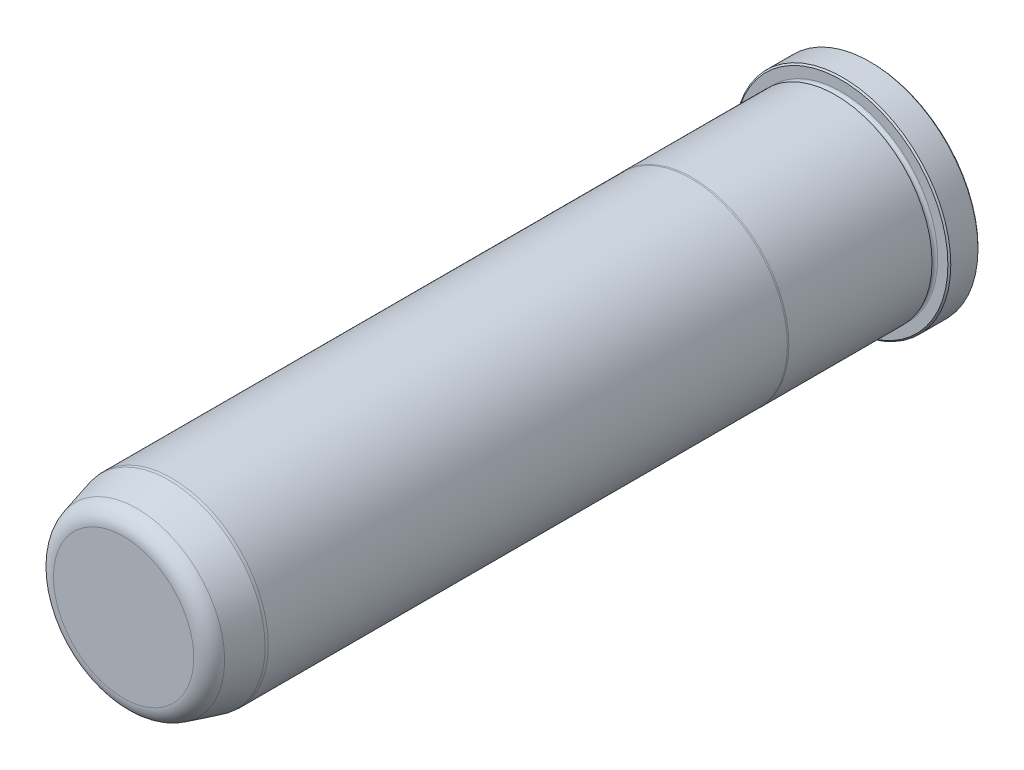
ISO-10303-21;
HEADER;
FILE_DESCRIPTION(('STEP AP214'),'2;1');
FILE_NAME('part.step','',(''),(''),'','','');
FILE_SCHEMA(('AUTOMOTIVE_DESIGN { 1 0 10303 214 1 1 1 1 }'));
ENDSEC;
DATA;
#1=APPLICATION_CONTEXT('core data for automotive mechanical design processes');
#2=APPLICATION_PROTOCOL_DEFINITION('international standard','automotive_design',2000,#1);
#3=PRODUCT_CONTEXT('',#1,'mechanical');
#4=PRODUCT('Part','Part','',(#3));
#5=PRODUCT_RELATED_PRODUCT_CATEGORY('part','',(#4));
#6=PRODUCT_DEFINITION_FORMATION('','',#4);
#7=PRODUCT_DEFINITION_CONTEXT('part definition',#1,'design');
#8=PRODUCT_DEFINITION('design','',#6,#7);
#9=PRODUCT_DEFINITION_SHAPE('','',#8);
#10=(LENGTH_UNIT() NAMED_UNIT(*) SI_UNIT(.MILLI.,.METRE.));
#11=(NAMED_UNIT(*) PLANE_ANGLE_UNIT() SI_UNIT($,.RADIAN.));
#12=(NAMED_UNIT(*) SI_UNIT($,.STERADIAN.) SOLID_ANGLE_UNIT());
#13=UNCERTAINTY_MEASURE_WITH_UNIT(LENGTH_MEASURE(1.E-05),#10,'distance_accuracy_value','');
#14=(GEOMETRIC_REPRESENTATION_CONTEXT(3) GLOBAL_UNCERTAINTY_ASSIGNED_CONTEXT((#13)) GLOBAL_UNIT_ASSIGNED_CONTEXT((#10,
#11,#12)) REPRESENTATION_CONTEXT('',''));
#15=CARTESIAN_POINT('',(0.,0.,0.));
#16=DIRECTION('',(0.,0.,1.));
#17=DIRECTION('',(1.,0.,0.));
#18=AXIS2_PLACEMENT_3D('',#15,#16,#17);
#19=CARTESIAN_POINT('',(0.,0.,0.));
#20=DIRECTION('',(0.,0.,1.));
#21=DIRECTION('',(1.,0.,0.));
#22=AXIS2_PLACEMENT_3D('',#19,#20,#21);
#23=PLANE('',#22);
#24=CARTESIAN_POINT('',(0.,0.,0.));
#25=DIRECTION('',(0.,0.,1.));
#26=DIRECTION('',(1.,0.,0.));
#27=AXIS2_PLACEMENT_3D('',#24,#25,#26);
#28=CIRCLE('',#27,28.067);
#29=CARTESIAN_POINT('',(28.067,0.,0.));
#30=VERTEX_POINT('',#29);
#31=EDGE_CURVE('E37',#30,#30,#28,.F.);
#32=ORIENTED_EDGE('',*,*,#31,.T.);
#33=EDGE_LOOP('',(#32));
#34=FACE_BOUND('',#33,.T.);
#35=ADVANCED_FACE('F30',(#34),#23,.F.);
#36=CARTESIAN_POINT('',(0.,0.,0.));
#37=DIRECTION('',(0.,0.,1.));
#38=DIRECTION('',(1.,0.,0.));
#39=AXIS2_PLACEMENT_3D('',#36,#37,#38);
#40=CYLINDRICAL_SURFACE('',#39,28.448);
#41=CARTESIAN_POINT('',(0.,0.,0.380999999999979));
#42=DIRECTION('',(0.,0.,1.));
#43=DIRECTION('',(1.,0.,0.));
#44=AXIS2_PLACEMENT_3D('',#41,#42,#43);
#45=CIRCLE('',#44,28.448);
#46=CARTESIAN_POINT('',(28.448,0.,0.380999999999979));
#47=VERTEX_POINT('',#46);
#48=EDGE_CURVE('E41',#47,#47,#45,.T.);
#49=ORIENTED_EDGE('',*,*,#48,.T.);
#50=EDGE_LOOP('',(#49));
#51=FACE_BOUND('',#50,.T.);
#52=CARTESIAN_POINT('',(0.,0.,7.54379999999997));
#53=DIRECTION('',(0.,0.,-1.));
#54=DIRECTION('',(-1.,0.,0.));
#55=AXIS2_PLACEMENT_3D('',#52,#53,#54);
#56=CIRCLE('',#55,28.448);
#57=CARTESIAN_POINT('',(-28.448,0.,7.54379999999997));
#58=VERTEX_POINT('',#57);
#59=EDGE_CURVE('E45',#58,#58,#56,.T.);
#60=ORIENTED_EDGE('',*,*,#59,.T.);
#61=EDGE_LOOP('',(#60));
#62=FACE_BOUND('',#61,.T.);
#63=ADVANCED_FACE('F118',(#51,#62),#40,.T.);
#64=CARTESIAN_POINT('',(0.,28.448,7.9248));
#65=DIRECTION('',(0.,0.,-1.));
#66=DIRECTION('',(-1.,0.,0.));
#67=AXIS2_PLACEMENT_3D('',#64,#65,#66);
#68=PLANE('',#67);
#69=CARTESIAN_POINT('',(0.,0.,7.9248));
#70=DIRECTION('',(0.,0.,-1.));
#71=DIRECTION('',(-1.,0.,0.));
#72=AXIS2_PLACEMENT_3D('',#69,#70,#71);
#73=CIRCLE('',#72,28.067);
#74=CARTESIAN_POINT('',(-28.067,0.,7.9248));
#75=VERTEX_POINT('',#74);
#76=EDGE_CURVE('E10',#75,#75,#73,.F.);
#77=ORIENTED_EDGE('',*,*,#76,.T.);
#78=EDGE_LOOP('',(#77));
#79=FACE_BOUND('',#78,.T.);
#80=CARTESIAN_POINT('',(0.,0.,7.9248));
#81=DIRECTION('',(0.,0.,1.));
#82=DIRECTION('',(1.,0.,0.));
#83=AXIS2_PLACEMENT_3D('',#80,#81,#82);
#84=CIRCLE('',#83,25.3873);
#85=CARTESIAN_POINT('',(25.3873,0.,7.9248));
#86=VERTEX_POINT('',#85);
#87=EDGE_CURVE('E56',#86,#86,#84,.T.);
#88=ORIENTED_EDGE('',*,*,#87,.F.);
#89=EDGE_LOOP('',(#88));
#90=FACE_BOUND('',#89,.T.);
#91=ADVANCED_FACE('F113',(#79,#90),#68,.F.);
#92=CARTESIAN_POINT('',(0.,0.,8.6868));
#93=DIRECTION('',(0.,0.,1.));
#94=DIRECTION('',(1.,0.,0.));
#95=AXIS2_PLACEMENT_3D('',#92,#93,#94);
#96=TOROIDAL_SURFACE('',#95,25.3873,0.761999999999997);
#97=CARTESIAN_POINT('',(0.,0.,9.44879999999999));
#98=DIRECTION('',(0.,0.,1.));
#99=DIRECTION('',(1.,0.,0.));
#100=AXIS2_PLACEMENT_3D('',#97,#98,#99);
#101=CIRCLE('',#100,25.3873);
#102=CARTESIAN_POINT('',(25.3873,0.,9.44879999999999));
#103=VERTEX_POINT('',#102);
#104=EDGE_CURVE('E59',#103,#103,#101,.T.);
#105=ORIENTED_EDGE('',*,*,#104,.F.);
#106=EDGE_LOOP('',(#105));
#107=FACE_BOUND('',#106,.T.);
#108=ORIENTED_EDGE('',*,*,#87,.T.);
#109=EDGE_LOOP('',(#108));
#110=FACE_BOUND('',#109,.T.);
#111=ADVANCED_FACE('F107',(#107,#110),#96,.F.);
#112=CARTESIAN_POINT('',(0.,25.3873,9.44879999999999));
#113=DIRECTION('',(0.,0.,1.));
#114=DIRECTION('',(1.,0.,0.));
#115=AXIS2_PLACEMENT_3D('',#112,#113,#114);
#116=PLANE('',#115);
#117=CARTESIAN_POINT('',(0.,0.,9.4488));
#118=DIRECTION('',(0.,0.,1.));
#119=DIRECTION('',(1.,0.,0.));
#120=AXIS2_PLACEMENT_3D('',#117,#118,#119);
#121=CIRCLE('',#120,25.4127);
#122=CARTESIAN_POINT('',(25.4127,0.,9.4488));
#123=VERTEX_POINT('',#122);
#124=EDGE_CURVE('E62',#123,#123,#121,.T.);
#125=ORIENTED_EDGE('',*,*,#124,.F.);
#126=EDGE_LOOP('',(#125));
#127=FACE_BOUND('',#126,.T.);
#128=ORIENTED_EDGE('',*,*,#104,.T.);
#129=EDGE_LOOP('',(#128));
#130=FACE_BOUND('',#129,.T.);
#131=ADVANCED_FACE('F101',(#127,#130),#116,.F.);
#132=CARTESIAN_POINT('',(0.,0.,0.));
#133=DIRECTION('',(0.,0.,1.));
#134=DIRECTION('',(1.,0.,0.));
#135=AXIS2_PLACEMENT_3D('',#132,#133,#134);
#136=CYLINDRICAL_SURFACE('',#135,25.4127);
#137=CARTESIAN_POINT('',(0.,0.,47.1347630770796));
#138=DIRECTION('',(0.,0.,1.));
#139=DIRECTION('',(1.,0.,0.));
#140=AXIS2_PLACEMENT_3D('',#137,#138,#139);
#141=CIRCLE('',#140,25.4127);
#142=CARTESIAN_POINT('',(25.4127,0.,47.1347630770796));
#143=VERTEX_POINT('',#142);
#144=EDGE_CURVE('E65',#143,#143,#141,.T.);
#145=ORIENTED_EDGE('',*,*,#144,.F.);
#146=EDGE_LOOP('',(#145));
#147=FACE_BOUND('',#146,.T.);
#148=ORIENTED_EDGE('',*,*,#124,.T.);
#149=EDGE_LOOP('',(#148));
#150=FACE_BOUND('',#149,.T.);
#151=ADVANCED_FACE('F95',(#147,#150),#136,.T.);
#152=CARTESIAN_POINT('',(0.,0.,47.1347630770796));
#153=DIRECTION('',(0.,0.,-1.));
#154=DIRECTION('',(-1.,0.,0.));
#155=AXIS2_PLACEMENT_3D('',#152,#153,#154);
#156=CONICAL_SURFACE('',#155,25.4127,0.0698131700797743);
#157=CARTESIAN_POINT('',(0.,0.,47.498));
#158=DIRECTION('',(0.,0.,1.));
#159=DIRECTION('',(1.,0.,0.));
#160=AXIS2_PLACEMENT_3D('',#157,#158,#159);
#161=CIRCLE('',#160,25.3873);
#162=CARTESIAN_POINT('',(25.3873,0.,47.498));
#163=VERTEX_POINT('',#162);
#164=EDGE_CURVE('E68',#163,#163,#161,.T.);
#165=ORIENTED_EDGE('',*,*,#164,.F.);
#166=EDGE_LOOP('',(#165));
#167=FACE_BOUND('',#166,.T.);
#168=ORIENTED_EDGE('',*,*,#144,.T.);
#169=EDGE_LOOP('',(#168));
#170=FACE_BOUND('',#169,.T.);
#171=ADVANCED_FACE('F89',(#167,#170),#156,.T.);
#172=CARTESIAN_POINT('',(0.,0.,0.));
#173=DIRECTION('',(0.,0.,1.));
#174=DIRECTION('',(1.,0.,0.));
#175=AXIS2_PLACEMENT_3D('',#172,#173,#174);
#176=CYLINDRICAL_SURFACE('',#175,25.3873);
#177=CARTESIAN_POINT('',(0.,0.,184.15));
#178=DIRECTION('',(0.,0.,1.));
#179=DIRECTION('',(1.,0.,0.));
#180=AXIS2_PLACEMENT_3D('',#177,#178,#179);
#181=CIRCLE('',#180,25.3873);
#182=CARTESIAN_POINT('',(25.3873,0.,184.15));
#183=VERTEX_POINT('',#182);
#184=EDGE_CURVE('E71',#183,#183,#181,.T.);
#185=ORIENTED_EDGE('',*,*,#184,.F.);
#186=EDGE_LOOP('',(#185));
#187=FACE_BOUND('',#186,.T.);
#188=ORIENTED_EDGE('',*,*,#164,.T.);
#189=EDGE_LOOP('',(#188));
#190=FACE_BOUND('',#189,.T.);
#191=ADVANCED_FACE('F83',(#187,#190),#176,.T.);
#192=CARTESIAN_POINT('',(0.,0.,184.15));
#193=DIRECTION('',(0.,0.,-1.));
#194=DIRECTION('',(-1.,0.,0.));
#195=AXIS2_PLACEMENT_3D('',#192,#193,#194);
#196=CONICAL_SURFACE('',#195,25.3873,0.0872664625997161);
#197=CARTESIAN_POINT('',(0.,0.,184.912));
#198=DIRECTION('',(0.,0.,1.));
#199=DIRECTION('',(1.,0.,0.));
#200=AXIS2_PLACEMENT_3D('',#197,#198,#199);
#201=CIRCLE('',#200,25.3206336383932);
#202=CARTESIAN_POINT('',(25.3206336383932,0.,184.912));
#203=VERTEX_POINT('',#202);
#204=EDGE_CURVE('E74',#203,#203,#201,.T.);
#205=ORIENTED_EDGE('',*,*,#204,.F.);
#206=EDGE_LOOP('',(#205));
#207=FACE_BOUND('',#206,.T.);
#208=ORIENTED_EDGE('',*,*,#184,.T.);
#209=EDGE_LOOP('',(#208));
#210=FACE_BOUND('',#209,.T.);
#211=ADVANCED_FACE('F80',(#207,#210),#196,.T.);
#212=CARTESIAN_POINT('',(0.,0.,184.912));
#213=DIRECTION('',(0.,0.,-1.));
#214=DIRECTION('',(-1.,0.,0.));
#215=AXIS2_PLACEMENT_3D('',#212,#213,#214);
#216=CONICAL_SURFACE('',#215,25.3206336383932,0.26179938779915);
#217=CARTESIAN_POINT('',(0.,0.,193.320125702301));
#218=DIRECTION('',(0.,0.,1.));
#219=DIRECTION('',(1.,0.,0.));
#220=AXIS2_PLACEMENT_3D('',#217,#218,#219);
#221=CIRCLE('',#220,23.0676831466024);
#222=CARTESIAN_POINT('',(23.0676831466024,0.,193.320125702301));
#223=VERTEX_POINT('',#222);
#224=EDGE_CURVE('E50',#223,#223,#221,.F.);
#225=ORIENTED_EDGE('',*,*,#224,.T.);
#226=EDGE_LOOP('',(#225));
#227=FACE_BOUND('',#226,.T.);
#228=ORIENTED_EDGE('',*,*,#204,.T.);
#229=EDGE_LOOP('',(#228));
#230=FACE_BOUND('',#229,.T.);
#231=ADVANCED_FACE('F78',(#227,#230),#216,.T.);
#232=CARTESIAN_POINT('',(0.,22.1218561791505,196.85));
#233=DIRECTION('',(0.,0.,-1.));
#234=DIRECTION('',(-1.,0.,0.));
#235=AXIS2_PLACEMENT_3D('',#232,#233,#234);
#236=PLANE('',#235);
#237=CARTESIAN_POINT('',(0.,0.,196.85));
#238=DIRECTION('',(0.,0.,-1.));
#239=DIRECTION('',(-1.,0.,0.));
#240=AXIS2_PLACEMENT_3D('',#237,#238,#239);
#241=CIRCLE('',#240,18.4674613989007);
#242=CARTESIAN_POINT('',(-18.4674613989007,0.,196.85));
#243=VERTEX_POINT('',#242);
#244=EDGE_CURVE('E53',#243,#243,#241,.F.);
#245=ORIENTED_EDGE('',*,*,#244,.T.);
#246=EDGE_LOOP('',(#245));
#247=FACE_BOUND('',#246,.T.);
#248=ADVANCED_FACE('F133',(#247),#236,.F.);
#249=CARTESIAN_POINT('',(0.,0.,192.0875));
#250=DIRECTION('',(0.,0.,-1.));
#251=DIRECTION('',(-1.,0.,0.));
#252=AXIS2_PLACEMENT_3D('',#249,#250,#251);
#253=TOROIDAL_SURFACE('',#252,18.4674613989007,4.7625);
#254=ORIENTED_EDGE('',*,*,#224,.F.);
#255=EDGE_LOOP('',(#254));
#256=FACE_BOUND('',#255,.T.);
#257=ORIENTED_EDGE('',*,*,#244,.F.);
#258=EDGE_LOOP('',(#257));
#259=FACE_BOUND('',#258,.T.);
#260=ADVANCED_FACE('F130',(#256,#259),#253,.T.);
#261=CARTESIAN_POINT('',(0.,0.,0.380999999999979));
#262=DIRECTION('',(0.,0.,1.));
#263=DIRECTION('',(1.,0.,0.));
#264=AXIS2_PLACEMENT_3D('',#261,#262,#263);
#265=CONICAL_SURFACE('',#264,28.448,0.785398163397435);
#266=ORIENTED_EDGE('',*,*,#31,.F.);
#267=EDGE_LOOP('',(#266));
#268=FACE_BOUND('',#267,.T.);
#269=ORIENTED_EDGE('',*,*,#48,.F.);
#270=EDGE_LOOP('',(#269));
#271=FACE_BOUND('',#270,.T.);
#272=ADVANCED_FACE('F132',(#268,#271),#265,.T.);
#273=CARTESIAN_POINT('',(0.,0.,7.9248));
#274=DIRECTION('',(0.,0.,-1.));
#275=DIRECTION('',(-1.,0.,0.));
#276=AXIS2_PLACEMENT_3D('',#273,#274,#275);
#277=CONICAL_SURFACE('',#276,28.067,0.785398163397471);
#278=ORIENTED_EDGE('',*,*,#59,.F.);
#279=EDGE_LOOP('',(#278));
#280=FACE_BOUND('',#279,.T.);
#281=ORIENTED_EDGE('',*,*,#76,.F.);
#282=EDGE_LOOP('',(#281));
#283=FACE_BOUND('',#282,.T.);
#284=ADVANCED_FACE('F32',(#280,#283),#277,.T.);
#285=CLOSED_SHELL('',(#35,#63,#91,#111,#131,#151,#171,#191,#211,#231,#248,#260,#272,#284));
#286=MANIFOLD_SOLID_BREP('B2',#285);
#287=ADVANCED_BREP_SHAPE_REPRESENTATION('',(#18,#286),#14);
#288=SHAPE_DEFINITION_REPRESENTATION(#9,#287);
ENDSEC;
END-ISO-10303-21;
